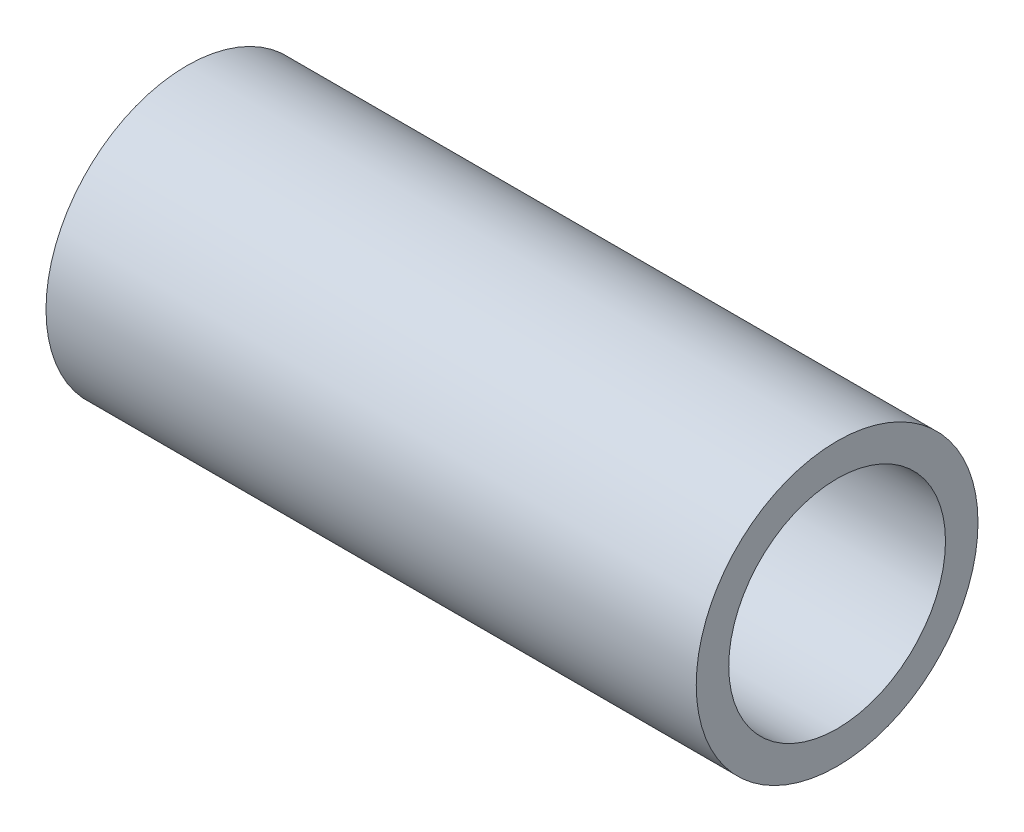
ISO-10303-21;
HEADER;
FILE_DESCRIPTION(('STEP AP214'),'2;1');
FILE_NAME('part.step','',(''),(''),'','','');
FILE_SCHEMA(('AUTOMOTIVE_DESIGN { 1 0 10303 214 1 1 1 1 }'));
ENDSEC;
DATA;
#1=APPLICATION_CONTEXT('core data for automotive mechanical design processes');
#2=APPLICATION_PROTOCOL_DEFINITION('international standard','automotive_design',2000,#1);
#3=PRODUCT_CONTEXT('',#1,'mechanical');
#4=PRODUCT('Part','Part','',(#3));
#5=PRODUCT_RELATED_PRODUCT_CATEGORY('part','',(#4));
#6=PRODUCT_DEFINITION_FORMATION('','',#4);
#7=PRODUCT_DEFINITION_CONTEXT('part definition',#1,'design');
#8=PRODUCT_DEFINITION('design','',#6,#7);
#9=PRODUCT_DEFINITION_SHAPE('','',#8);
#10=(LENGTH_UNIT() NAMED_UNIT(*) SI_UNIT(.MILLI.,.METRE.));
#11=(NAMED_UNIT(*) PLANE_ANGLE_UNIT() SI_UNIT($,.RADIAN.));
#12=(NAMED_UNIT(*) SI_UNIT($,.STERADIAN.) SOLID_ANGLE_UNIT());
#13=UNCERTAINTY_MEASURE_WITH_UNIT(LENGTH_MEASURE(1.E-05),#10,'distance_accuracy_value','');
#14=(GEOMETRIC_REPRESENTATION_CONTEXT(3) GLOBAL_UNCERTAINTY_ASSIGNED_CONTEXT((#13)) GLOBAL_UNIT_ASSIGNED_CONTEXT((#10,
#11,#12)) REPRESENTATION_CONTEXT('',''));
#15=CARTESIAN_POINT('',(0.,0.,0.));
#16=DIRECTION('',(0.,0.,1.));
#17=DIRECTION('',(1.,0.,0.));
#18=AXIS2_PLACEMENT_3D('',#15,#16,#17);
#19=CARTESIAN_POINT('',(76.2,0.,0.));
#20=DIRECTION('',(-1.,0.,0.));
#21=DIRECTION('',(0.,0.,1.));
#22=AXIS2_PLACEMENT_3D('',#19,#20,#21);
#23=CYLINDRICAL_SURFACE('',#22,12.7);
#24=CARTESIAN_POINT('',(76.2,0.,0.));
#25=DIRECTION('',(1.,0.,0.));
#26=DIRECTION('',(0.,0.,-1.));
#27=AXIS2_PLACEMENT_3D('',#24,#25,#26);
#28=CIRCLE('',#27,12.7);
#29=CARTESIAN_POINT('',(76.2,0.,12.7));
#30=VERTEX_POINT('',#29);
#31=EDGE_CURVE('E45',#30,#30,#28,.T.);
#32=CARTESIAN_POINT('',(0.,0.,0.));
#33=DIRECTION('',(1.,0.,0.));
#34=DIRECTION('',(0.,0.,-1.));
#35=AXIS2_PLACEMENT_3D('',#32,#33,#34);
#36=CIRCLE('',#35,12.7);
#37=CARTESIAN_POINT('',(0.,0.,12.7));
#38=VERTEX_POINT('',#37);
#39=EDGE_CURVE('E51',#38,#38,#36,.T.);
#40=CARTESIAN_POINT('',(76.2,0.,12.7));
#41=CARTESIAN_POINT('',(75.40625,0.,12.7));
#42=CARTESIAN_POINT('',(74.6125,0.,12.7));
#43=CARTESIAN_POINT('',(73.025,0.,12.7));
#44=CARTESIAN_POINT('',(72.23125,0.,12.7));
#45=CARTESIAN_POINT('',(70.64375,0.,12.7));
#46=CARTESIAN_POINT('',(69.85,0.,12.7));
#47=CARTESIAN_POINT('',(68.2625,0.,12.7));
#48=CARTESIAN_POINT('',(67.46875,0.,12.7));
#49=CARTESIAN_POINT('',(65.88125,0.,12.7));
#50=CARTESIAN_POINT('',(65.0875,0.,12.7));
#51=CARTESIAN_POINT('',(63.5,0.,12.7));
#52=CARTESIAN_POINT('',(62.70625,0.,12.7));
#53=CARTESIAN_POINT('',(61.11875,0.,12.7));
#54=CARTESIAN_POINT('',(60.325,0.,12.7));
#55=CARTESIAN_POINT('',(58.7375,0.,12.7));
#56=CARTESIAN_POINT('',(57.94375,0.,12.7));
#57=CARTESIAN_POINT('',(56.35625,0.,12.7));
#58=CARTESIAN_POINT('',(55.5625,0.,12.7));
#59=CARTESIAN_POINT('',(53.975,0.,12.7));
#60=CARTESIAN_POINT('',(53.18125,0.,12.7));
#61=CARTESIAN_POINT('',(51.59375,0.,12.7));
#62=CARTESIAN_POINT('',(50.8,0.,12.7));
#63=CARTESIAN_POINT('',(49.2125,0.,12.7));
#64=CARTESIAN_POINT('',(48.41875,0.,12.7));
#65=CARTESIAN_POINT('',(46.83125,0.,12.7));
#66=CARTESIAN_POINT('',(46.0375,0.,12.7));
#67=CARTESIAN_POINT('',(44.45,0.,12.7));
#68=CARTESIAN_POINT('',(43.65625,0.,12.7));
#69=CARTESIAN_POINT('',(42.06875,0.,12.7));
#70=CARTESIAN_POINT('',(41.275,0.,12.7));
#71=CARTESIAN_POINT('',(39.6875,0.,12.7));
#72=CARTESIAN_POINT('',(38.89375,0.,12.7));
#73=CARTESIAN_POINT('',(37.30625,0.,12.7));
#74=CARTESIAN_POINT('',(36.5125,0.,12.7));
#75=CARTESIAN_POINT('',(34.925,0.,12.7));
#76=CARTESIAN_POINT('',(34.13125,0.,12.7));
#77=CARTESIAN_POINT('',(32.54375,0.,12.7));
#78=CARTESIAN_POINT('',(31.75,0.,12.7));
#79=CARTESIAN_POINT('',(30.1625,0.,12.7));
#80=CARTESIAN_POINT('',(29.36875,0.,12.7));
#81=CARTESIAN_POINT('',(27.78125,0.,12.7));
#82=CARTESIAN_POINT('',(26.9875,0.,12.7));
#83=CARTESIAN_POINT('',(25.4,0.,12.7));
#84=CARTESIAN_POINT('',(24.60625,0.,12.7));
#85=CARTESIAN_POINT('',(23.01875,0.,12.7));
#86=CARTESIAN_POINT('',(22.225,0.,12.7));
#87=CARTESIAN_POINT('',(20.6375,0.,12.7));
#88=CARTESIAN_POINT('',(19.84375,0.,12.7));
#89=CARTESIAN_POINT('',(18.25625,0.,12.7));
#90=CARTESIAN_POINT('',(17.4625,0.,12.7));
#91=CARTESIAN_POINT('',(15.875,0.,12.7));
#92=CARTESIAN_POINT('',(15.08125,0.,12.7));
#93=CARTESIAN_POINT('',(13.49375,0.,12.7));
#94=CARTESIAN_POINT('',(12.7,0.,12.7));
#95=CARTESIAN_POINT('',(11.1125,0.,12.7));
#96=CARTESIAN_POINT('',(10.31875,0.,12.7));
#97=CARTESIAN_POINT('',(8.73125,0.,12.7));
#98=CARTESIAN_POINT('',(7.93750000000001,0.,12.7));
#99=CARTESIAN_POINT('',(6.35,0.,12.7));
#100=CARTESIAN_POINT('',(5.55625,0.,12.7));
#101=CARTESIAN_POINT('',(3.96875,0.,12.7));
#102=CARTESIAN_POINT('',(3.175,0.,12.7));
#103=CARTESIAN_POINT('',(1.5875,0.,12.7));
#104=CARTESIAN_POINT('',(0.793750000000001,0.,12.7));
#105=CARTESIAN_POINT('',(0.,0.,12.7));
#106=B_SPLINE_CURVE_WITH_KNOTS('',3,(#40,#41,#42,#43,#44,#45,#46,#47,#48,#49,#50,#51,#52,#53,
#54,#55,#56,#57,#58,#59,#60,#61,#62,#63,#64,#65,#66,#67,#68,#69,#70,#71,#72,#73,#74,#75,#76,#77,
#78,#79,#80,#81,#82,#83,#84,#85,#86,#87,#88,#89,#90,#91,#92,#93,#94,#95,#96,#97,#98,#99,#100,
#101,#102,#103,#104,#105),.UNSPECIFIED.,.F.,.F.,(4,2,2,2,2,2,2,2,2,2,2,2,2,2,2,2,2,2,2,2,2,2,2,
2,2,2,2,2,2,2,2,2,4),(0.,2.38124999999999,4.76249999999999,7.14374999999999,9.52499999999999,
11.90625,14.2875,16.66875,19.05,21.43125,23.8125,26.19375,28.575,30.95625,33.3375,35.71875,38.1,
40.48125,42.8625,45.24375,47.625,50.00625,52.3875,54.76875,57.15,59.53125,61.9125,64.29375,
66.675,69.05625,71.4375,73.81875,76.2),.UNSPECIFIED.);
#107=EDGE_CURVE('BSEAM38',#30,#38,#106,.T.);
#108=ORIENTED_EDGE('',*,*,#31,.T.);
#109=ORIENTED_EDGE('',*,*,#39,.F.);
#110=ORIENTED_EDGE('',*,*,#107,.T.);
#111=ORIENTED_EDGE('',*,*,#107,.F.);
#112=EDGE_LOOP('',(#108,#110,#109,#111));
#113=FACE_BOUND('',#112,.T.);
#114=ADVANCED_FACE('F38',(#113),#23,.F.);
#115=CARTESIAN_POINT('',(76.2,0.,0.));
#116=DIRECTION('',(-1.,0.,0.));
#117=DIRECTION('',(0.,0.,1.));
#118=AXIS2_PLACEMENT_3D('',#115,#116,#117);
#119=CYLINDRICAL_SURFACE('',#118,16.51);
#120=CARTESIAN_POINT('',(76.2,0.,0.));
#121=DIRECTION('',(1.,0.,0.));
#122=DIRECTION('',(0.,0.,-1.));
#123=AXIS2_PLACEMENT_3D('',#120,#121,#122);
#124=CIRCLE('',#123,16.51);
#125=CARTESIAN_POINT('',(76.2,0.,16.51));
#126=VERTEX_POINT('',#125);
#127=EDGE_CURVE('E10',#126,#126,#124,.T.);
#128=CARTESIAN_POINT('',(0.,0.,0.));
#129=DIRECTION('',(1.,0.,0.));
#130=DIRECTION('',(0.,0.,-1.));
#131=AXIS2_PLACEMENT_3D('',#128,#129,#130);
#132=CIRCLE('',#131,16.51);
#133=CARTESIAN_POINT('',(0.,0.,16.51));
#134=VERTEX_POINT('',#133);
#135=EDGE_CURVE('E41',#134,#134,#132,.T.);
#136=CARTESIAN_POINT('',(76.2,0.,16.51));
#137=CARTESIAN_POINT('',(75.40625,0.,16.51));
#138=CARTESIAN_POINT('',(74.6125,0.,16.51));
#139=CARTESIAN_POINT('',(73.025,0.,16.51));
#140=CARTESIAN_POINT('',(72.23125,0.,16.51));
#141=CARTESIAN_POINT('',(70.64375,0.,16.51));
#142=CARTESIAN_POINT('',(69.85,0.,16.51));
#143=CARTESIAN_POINT('',(68.2625,0.,16.51));
#144=CARTESIAN_POINT('',(67.46875,0.,16.51));
#145=CARTESIAN_POINT('',(65.88125,0.,16.51));
#146=CARTESIAN_POINT('',(65.0875,0.,16.51));
#147=CARTESIAN_POINT('',(63.5,0.,16.51));
#148=CARTESIAN_POINT('',(62.70625,0.,16.51));
#149=CARTESIAN_POINT('',(61.11875,0.,16.51));
#150=CARTESIAN_POINT('',(60.325,0.,16.51));
#151=CARTESIAN_POINT('',(58.7375,0.,16.51));
#152=CARTESIAN_POINT('',(57.94375,0.,16.51));
#153=CARTESIAN_POINT('',(56.35625,0.,16.51));
#154=CARTESIAN_POINT('',(55.5625,0.,16.51));
#155=CARTESIAN_POINT('',(53.975,0.,16.51));
#156=CARTESIAN_POINT('',(53.18125,0.,16.51));
#157=CARTESIAN_POINT('',(51.59375,0.,16.51));
#158=CARTESIAN_POINT('',(50.8,0.,16.51));
#159=CARTESIAN_POINT('',(49.2125,0.,16.51));
#160=CARTESIAN_POINT('',(48.41875,0.,16.51));
#161=CARTESIAN_POINT('',(46.83125,0.,16.51));
#162=CARTESIAN_POINT('',(46.0375,0.,16.51));
#163=CARTESIAN_POINT('',(44.45,0.,16.51));
#164=CARTESIAN_POINT('',(43.65625,0.,16.51));
#165=CARTESIAN_POINT('',(42.06875,0.,16.51));
#166=CARTESIAN_POINT('',(41.275,0.,16.51));
#167=CARTESIAN_POINT('',(39.6875,0.,16.51));
#168=CARTESIAN_POINT('',(38.89375,0.,16.51));
#169=CARTESIAN_POINT('',(37.30625,0.,16.51));
#170=CARTESIAN_POINT('',(36.5125,0.,16.51));
#171=CARTESIAN_POINT('',(34.925,0.,16.51));
#172=CARTESIAN_POINT('',(34.13125,0.,16.51));
#173=CARTESIAN_POINT('',(32.54375,0.,16.51));
#174=CARTESIAN_POINT('',(31.75,0.,16.51));
#175=CARTESIAN_POINT('',(30.1625,0.,16.51));
#176=CARTESIAN_POINT('',(29.36875,0.,16.51));
#177=CARTESIAN_POINT('',(27.78125,0.,16.51));
#178=CARTESIAN_POINT('',(26.9875,0.,16.51));
#179=CARTESIAN_POINT('',(25.4,0.,16.51));
#180=CARTESIAN_POINT('',(24.60625,0.,16.51));
#181=CARTESIAN_POINT('',(23.01875,0.,16.51));
#182=CARTESIAN_POINT('',(22.225,0.,16.51));
#183=CARTESIAN_POINT('',(20.6375,0.,16.51));
#184=CARTESIAN_POINT('',(19.84375,0.,16.51));
#185=CARTESIAN_POINT('',(18.25625,0.,16.51));
#186=CARTESIAN_POINT('',(17.4625,0.,16.51));
#187=CARTESIAN_POINT('',(15.875,0.,16.51));
#188=CARTESIAN_POINT('',(15.08125,0.,16.51));
#189=CARTESIAN_POINT('',(13.49375,0.,16.51));
#190=CARTESIAN_POINT('',(12.7,0.,16.51));
#191=CARTESIAN_POINT('',(11.1125,0.,16.51));
#192=CARTESIAN_POINT('',(10.31875,0.,16.51));
#193=CARTESIAN_POINT('',(8.73125,0.,16.51));
#194=CARTESIAN_POINT('',(7.93750000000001,0.,16.51));
#195=CARTESIAN_POINT('',(6.35,0.,16.51));
#196=CARTESIAN_POINT('',(5.55625,0.,16.51));
#197=CARTESIAN_POINT('',(3.96875,0.,16.51));
#198=CARTESIAN_POINT('',(3.175,0.,16.51));
#199=CARTESIAN_POINT('',(1.5875,0.,16.51));
#200=CARTESIAN_POINT('',(0.793750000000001,0.,16.51));
#201=CARTESIAN_POINT('',(0.,0.,16.51));
#202=B_SPLINE_CURVE_WITH_KNOTS('',3,(#136,#137,#138,#139,#140,#141,#142,#143,#144,#145,#146,
#147,#148,#149,#150,#151,#152,#153,#154,#155,#156,#157,#158,#159,#160,#161,#162,#163,#164,#165,
#166,#167,#168,#169,#170,#171,#172,#173,#174,#175,#176,#177,#178,#179,#180,#181,#182,#183,#184,
#185,#186,#187,#188,#189,#190,#191,#192,#193,#194,#195,#196,#197,#198,#199,#200,#201),
.UNSPECIFIED.,.F.,.F.,(4,2,2,2,2,2,2,2,2,2,2,2,2,2,2,2,2,2,2,2,2,2,2,2,2,2,2,2,2,2,2,2,4),(0.,
2.38124999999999,4.76249999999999,7.14374999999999,9.52499999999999,11.90625,14.2875,16.66875,
19.05,21.43125,23.8125,26.19375,28.575,30.95625,33.3375,35.71875,38.1,40.48125,42.8625,45.24375,
47.625,50.00625,52.3875,54.76875,57.15,59.53125,61.9125,64.29375,66.675,69.05625,71.4375,
73.81875,76.2),.UNSPECIFIED.);
#203=EDGE_CURVE('BSEAM58',#126,#134,#202,.T.);
#204=ORIENTED_EDGE('',*,*,#127,.F.);
#205=ORIENTED_EDGE('',*,*,#135,.T.);
#206=ORIENTED_EDGE('',*,*,#203,.T.);
#207=ORIENTED_EDGE('',*,*,#203,.F.);
#208=EDGE_LOOP('',(#204,#206,#205,#207));
#209=FACE_BOUND('',#208,.T.);
#210=ADVANCED_FACE('F58',(#209),#119,.T.);
#211=CARTESIAN_POINT('',(76.2,0.,0.));
#212=DIRECTION('',(1.,0.,0.));
#213=DIRECTION('',(0.,0.,-1.));
#214=AXIS2_PLACEMENT_3D('',#211,#212,#213);
#215=PLANE('',#214);
#216=ORIENTED_EDGE('',*,*,#31,.F.);
#217=EDGE_LOOP('',(#216));
#218=FACE_BOUND('',#217,.T.);
#219=ORIENTED_EDGE('',*,*,#127,.T.);
#220=EDGE_LOOP('',(#219));
#221=FACE_BOUND('',#220,.T.);
#222=ADVANCED_FACE('F62',(#218,#221),#215,.T.);
#223=CARTESIAN_POINT('',(0.,0.,0.));
#224=DIRECTION('',(1.,0.,0.));
#225=DIRECTION('',(0.,0.,-1.));
#226=AXIS2_PLACEMENT_3D('',#223,#224,#225);
#227=PLANE('',#226);
#228=ORIENTED_EDGE('',*,*,#39,.T.);
#229=EDGE_LOOP('',(#228));
#230=FACE_BOUND('',#229,.T.);
#231=ORIENTED_EDGE('',*,*,#135,.F.);
#232=EDGE_LOOP('',(#231));
#233=FACE_BOUND('',#232,.T.);
#234=ADVANCED_FACE('F60',(#230,#233),#227,.F.);
#235=CLOSED_SHELL('',(#114,#210,#222,#234));
#236=MANIFOLD_SOLID_BREP('B2',#235);
#237=ADVANCED_BREP_SHAPE_REPRESENTATION('',(#18,#236),#14);
#238=SHAPE_DEFINITION_REPRESENTATION(#9,#237);
ENDSEC;
END-ISO-10303-21;
